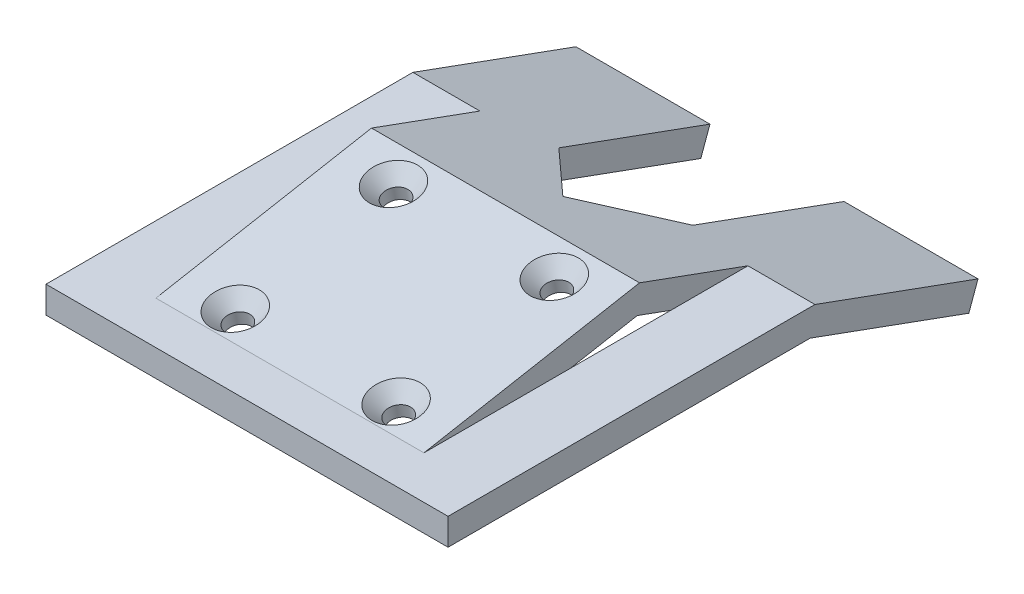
ISO-10303-21;
HEADER;
FILE_DESCRIPTION(('STEP AP214'),'2;1');
FILE_NAME('part.step','',(''),(''),'','','');
FILE_SCHEMA(('AUTOMOTIVE_DESIGN { 1 0 10303 214 1 1 1 1 }'));
ENDSEC;
DATA;
#1=APPLICATION_CONTEXT('core data for automotive mechanical design processes');
#2=APPLICATION_PROTOCOL_DEFINITION('international standard','automotive_design',2000,#1);
#3=PRODUCT_CONTEXT('',#1,'mechanical');
#4=PRODUCT('Part','Part','',(#3));
#5=PRODUCT_RELATED_PRODUCT_CATEGORY('part','',(#4));
#6=PRODUCT_DEFINITION_FORMATION('','',#4);
#7=PRODUCT_DEFINITION_CONTEXT('part definition',#1,'design');
#8=PRODUCT_DEFINITION('design','',#6,#7);
#9=PRODUCT_DEFINITION_SHAPE('','',#8);
#10=(LENGTH_UNIT() NAMED_UNIT(*) SI_UNIT(.MILLI.,.METRE.));
#11=(NAMED_UNIT(*) PLANE_ANGLE_UNIT() SI_UNIT($,.RADIAN.));
#12=(NAMED_UNIT(*) SI_UNIT($,.STERADIAN.) SOLID_ANGLE_UNIT());
#13=UNCERTAINTY_MEASURE_WITH_UNIT(LENGTH_MEASURE(1.E-05),#10,'distance_accuracy_value','');
#14=(GEOMETRIC_REPRESENTATION_CONTEXT(3) GLOBAL_UNCERTAINTY_ASSIGNED_CONTEXT((#13)) GLOBAL_UNIT_ASSIGNED_CONTEXT((#10,
#11,#12)) REPRESENTATION_CONTEXT('',''));
#15=CARTESIAN_POINT('',(0.,0.,0.));
#16=DIRECTION('',(0.,0.,1.));
#17=DIRECTION('',(1.,0.,0.));
#18=AXIS2_PLACEMENT_3D('',#15,#16,#17);
#19=CARTESIAN_POINT('',(-37.5,-2.5,-67.5591825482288));
#20=DIRECTION('',(0.,0.939692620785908,-0.342020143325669));
#21=DIRECTION('',(0.,0.342020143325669,0.939692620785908));
#22=AXIS2_PLACEMENT_3D('',#19,#20,#21);
#23=PLANE('',#22);
#24=DIRECTION('',(0.707106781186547,-0.241844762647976,-0.664463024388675));
#25=VECTOR('',#24,1.);
#26=CARTESIAN_POINT('',(-13.2422578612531,5.79663644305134,-44.764361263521));
#27=LINE('',#26,#25);
#28=CARTESIAN_POINT('',(11.9537005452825,-2.82088886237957,-68.4408174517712));
#29=VERTEX_POINT('',#28);
#30=CARTESIAN_POINT('',(12.5,-3.00773428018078,-68.9541710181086));
#31=VERTEX_POINT('',#30);
#32=EDGE_CURVE('E282',#29,#31,#27,.T.);
#33=ORIENTED_EDGE('',*,*,#32,.T.);
#34=DIRECTION('',(0.,-0.342020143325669,-0.939692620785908));
#35=VECTOR('',#34,1.);
#36=CARTESIAN_POINT('',(12.5,-2.5,-67.5591825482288));
#37=LINE('',#36,#35);
#38=CARTESIAN_POINT('',(12.5,-13.2683385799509,-97.1449496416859));
#39=VERTEX_POINT('',#38);
#40=EDGE_CURVE('E286',#31,#39,#37,.T.);
#41=ORIENTED_EDGE('',*,*,#40,.T.);
#42=DIRECTION('',(-1.,0.,0.));
#43=VECTOR('',#42,1.);
#44=CARTESIAN_POINT('',(-37.5,-13.2683385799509,-97.1449496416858));
#45=LINE('',#44,#43);
#46=CARTESIAN_POINT('',(37.5,-13.2683385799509,-97.1449496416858));
#47=VERTEX_POINT('',#46);
#48=EDGE_CURVE('E372',#47,#39,#45,.T.);
#49=ORIENTED_EDGE('',*,*,#48,.F.);
#50=DIRECTION('',(0.,-0.342020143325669,-0.939692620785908));
#51=VECTOR('',#50,1.);
#52=CARTESIAN_POINT('',(37.5,-2.5,-67.5591825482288));
#53=LINE('',#52,#51);
#54=CARTESIAN_POINT('',(37.5,-2.5,-67.5591825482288));
#55=VERTEX_POINT('',#54);
#56=EDGE_CURVE('E406',#55,#47,#53,.T.);
#57=ORIENTED_EDGE('',*,*,#56,.F.);
#58=DIRECTION('',(1.,0.,0.));
#59=VECTOR('',#58,1.);
#60=CARTESIAN_POINT('',(-37.5,-2.5,-67.5591825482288));
#61=LINE('',#60,#59);
#62=CARTESIAN_POINT('',(25.,-2.5,-67.5591825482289));
#63=VERTEX_POINT('',#62);
#64=EDGE_CURVE('E379',#63,#55,#61,.T.);
#65=ORIENTED_EDGE('',*,*,#64,.F.);
#66=DIRECTION('',(0.,-0.342020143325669,-0.939692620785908));
#67=VECTOR('',#66,1.);
#68=CARTESIAN_POINT('',(25.,-2.5,-67.5591825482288));
#69=LINE('',#68,#67);
#70=CARTESIAN_POINT('',(25.,-2.82088886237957,-68.4408174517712));
#71=VERTEX_POINT('',#70);
#72=EDGE_CURVE('E362',#63,#71,#69,.T.);
#73=ORIENTED_EDGE('',*,*,#72,.T.);
#74=DIRECTION('',(-1.,0.,0.));
#75=VECTOR('',#74,1.);
#76=CARTESIAN_POINT('',(-37.5,-2.82088886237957,-68.4408174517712));
#77=LINE('',#76,#75);
#78=EDGE_CURVE('E365',#71,#29,#77,.T.);
#79=ORIENTED_EDGE('',*,*,#78,.T.);
#80=EDGE_LOOP('',(#33,#41,#49,#57,#65,#73,#79));
#81=FACE_BOUND('',#80,.T.);
#82=ADVANCED_FACE('F36',(#81),#23,.F.);
#83=CARTESIAN_POINT('',(0.,-10.9191070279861,-98.));
#84=DIRECTION('',(0.,-0.342020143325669,-0.939692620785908));
#85=DIRECTION('',(0.,0.939692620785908,-0.342020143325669));
#86=AXIS2_PLACEMENT_3D('',#83,#84,#85);
#87=PLANE('',#86);
#88=DIRECTION('',(0.,-0.939692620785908,0.342020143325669));
#89=VECTOR('',#88,1.);
#90=CARTESIAN_POINT('',(12.5,-10.9191070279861,-98.));
#91=LINE('',#90,#89);
#92=CARTESIAN_POINT('',(12.5,-8.56987547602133,-98.8550503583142));
#93=VERTEX_POINT('',#92);
#94=EDGE_CURVE('E12',#93,#39,#91,.T.);
#95=ORIENTED_EDGE('',*,*,#94,.F.);
#96=DIRECTION('',(1.,0.,0.));
#97=VECTOR('',#96,1.);
#98=CARTESIAN_POINT('',(-37.5,-8.56987547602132,-98.8550503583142));
#99=LINE('',#98,#97);
#100=CARTESIAN_POINT('',(37.5,-8.56987547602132,-98.8550503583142));
#101=VERTEX_POINT('',#100);
#102=EDGE_CURVE('E215',#93,#101,#99,.T.);
#103=ORIENTED_EDGE('',*,*,#102,.T.);
#104=DIRECTION('',(0.,-0.939692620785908,0.342020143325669));
#105=VECTOR('',#104,1.);
#106=CARTESIAN_POINT('',(37.5,-1.11847977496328,-101.567136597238));
#107=LINE('',#106,#105);
#108=EDGE_CURVE('E369',#101,#47,#107,.T.);
#109=ORIENTED_EDGE('',*,*,#108,.T.);
#110=ORIENTED_EDGE('',*,*,#48,.T.);
#111=EDGE_LOOP('',(#95,#103,#109,#110));
#112=FACE_BOUND('',#111,.T.);
#113=ADVANCED_FACE('F452',(#112),#87,.T.);
#114=CARTESIAN_POINT('',(-25.,-13.2683385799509,-68.4408174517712));
#115=DIRECTION('',(0.,0.,-1.));
#116=DIRECTION('',(-1.,0.,0.));
#117=AXIS2_PLACEMENT_3D('',#114,#115,#116);
#118=PLANE('',#117);
#119=DIRECTION('',(1.,0.,0.));
#120=VECTOR('',#119,1.);
#121=CARTESIAN_POINT('',(25.,-2.73398666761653,-68.4408174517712));
#122=LINE('',#121,#120);
#123=CARTESIAN_POINT('',(11.9239782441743,-2.73398666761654,-68.4408174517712));
#124=VERTEX_POINT('',#123);
#125=CARTESIAN_POINT('',(25.,-2.73398666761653,-68.4408174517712));
#126=VERTEX_POINT('',#125);
#127=EDGE_CURVE('E308',#124,#126,#122,.T.);
#128=ORIENTED_EDGE('',*,*,#127,.F.);
#129=DIRECTION('',(0.323615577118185,-0.946188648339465,0.));
#130=VECTOR('',#129,1.);
#131=CARTESIAN_POINT('',(11.2826723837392,-0.858933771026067,-68.4408174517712));
#132=LINE('',#131,#130);
#133=EDGE_CURVE('E255',#124,#29,#132,.T.);
#134=ORIENTED_EDGE('',*,*,#133,.T.);
#135=ORIENTED_EDGE('',*,*,#78,.F.);
#136=DIRECTION('',(0.,1.,0.));
#137=VECTOR('',#136,1.);
#138=CARTESIAN_POINT('',(25.,-13.2683385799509,-68.4408174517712));
#139=LINE('',#138,#137);
#140=EDGE_CURVE('E354',#71,#126,#139,.T.);
#141=ORIENTED_EDGE('',*,*,#140,.T.);
#142=EDGE_LOOP('',(#128,#134,#135,#141));
#143=FACE_BOUND('',#142,.T.);
#144=ADVANCED_FACE('F479',(#143),#118,.F.);
#145=CARTESIAN_POINT('',(25.,-13.2683385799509,-8.));
#146=DIRECTION('',(1.,0.,0.));
#147=DIRECTION('',(0.,0.,-1.));
#148=AXIS2_PLACEMENT_3D('',#145,#146,#147);
#149=PLANE('',#148);
#150=DIRECTION('',(0.,0.,-1.));
#151=VECTOR('',#150,1.);
#152=CARTESIAN_POINT('',(25.,2.5,-8.));
#153=LINE('',#152,#151);
#154=CARTESIAN_POINT('',(25.,2.5,-35.3250324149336));
#155=VERTEX_POINT('',#154);
#156=CARTESIAN_POINT('',(25.,2.50000000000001,-54.0605572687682));
#157=VERTEX_POINT('',#156);
#158=EDGE_CURVE('E343',#155,#157,#153,.T.);
#159=ORIENTED_EDGE('',*,*,#158,.T.);
#160=DIRECTION('',(0.,-0.342020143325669,-0.939692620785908));
#161=VECTOR('',#160,1.);
#162=CARTESIAN_POINT('',(25.,4.78134691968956,-47.7926081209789));
#163=LINE('',#162,#161);
#164=EDGE_CURVE('E332',#157,#126,#163,.T.);
#165=ORIENTED_EDGE('',*,*,#164,.T.);
#166=ORIENTED_EDGE('',*,*,#140,.F.);
#167=ORIENTED_EDGE('',*,*,#72,.F.);
#168=DIRECTION('',(0.,0.,1.));
#169=VECTOR('',#168,1.);
#170=CARTESIAN_POINT('',(25.,-2.5,-143.166481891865));
#171=LINE('',#170,#169);
#172=CARTESIAN_POINT('',(25.,-2.5,-8.));
#173=VERTEX_POINT('',#172);
#174=EDGE_CURVE('E225',#63,#173,#171,.T.);
#175=ORIENTED_EDGE('',*,*,#174,.T.);
#176=DIRECTION('',(0.,-0.179993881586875,0.983667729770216));
#177=VECTOR('',#176,1.);
#178=CARTESIAN_POINT('',(25.,13.8650675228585,-97.4352001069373));
#179=LINE('',#178,#177);
#180=EDGE_CURVE('E59',#155,#173,#179,.T.);
#181=ORIENTED_EDGE('',*,*,#180,.F.);
#182=EDGE_LOOP('',(#159,#165,#166,#167,#175,#181));
#183=FACE_BOUND('',#182,.T.);
#184=ADVANCED_FACE('F476',(#183),#149,.F.);
#185=CARTESIAN_POINT('',(-25.,-13.2683385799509,-8.));
#186=DIRECTION('',(-1.,0.,0.));
#187=DIRECTION('',(0.,0.,1.));
#188=AXIS2_PLACEMENT_3D('',#185,#186,#187);
#189=PLANE('',#188);
#190=DIRECTION('',(0.,1.,0.));
#191=VECTOR('',#190,1.);
#192=CARTESIAN_POINT('',(-25.,-13.2683385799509,-68.4408174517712));
#193=LINE('',#192,#191);
#194=CARTESIAN_POINT('',(-25.,-2.82088886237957,-68.4408174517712));
#195=VERTEX_POINT('',#194);
#196=CARTESIAN_POINT('',(-25.,-2.73398666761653,-68.4408174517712));
#197=VERTEX_POINT('',#196);
#198=EDGE_CURVE('E355',#195,#197,#193,.T.);
#199=ORIENTED_EDGE('',*,*,#198,.T.);
#200=DIRECTION('',(0.,-0.342020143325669,-0.939692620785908));
#201=VECTOR('',#200,1.);
#202=CARTESIAN_POINT('',(-25.,4.78134691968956,-47.7926081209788));
#203=LINE('',#202,#201);
#204=CARTESIAN_POINT('',(-25.,2.5,-54.0605572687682));
#205=VERTEX_POINT('',#204);
#206=EDGE_CURVE('E329',#205,#197,#203,.T.);
#207=ORIENTED_EDGE('',*,*,#206,.F.);
#208=DIRECTION('',(0.,0.,1.));
#209=VECTOR('',#208,1.);
#210=CARTESIAN_POINT('',(-25.,2.5,-8.));
#211=LINE('',#210,#209);
#212=CARTESIAN_POINT('',(-25.,2.5,-35.3250324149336));
#213=VERTEX_POINT('',#212);
#214=EDGE_CURVE('E347',#205,#213,#211,.T.);
#215=ORIENTED_EDGE('',*,*,#214,.T.);
#216=DIRECTION('',(0.,-0.179993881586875,0.983667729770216));
#217=VECTOR('',#216,1.);
#218=CARTESIAN_POINT('',(-25.,13.8650675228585,-97.4352001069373));
#219=LINE('',#218,#217);
#220=CARTESIAN_POINT('',(-25.,-2.5,-8.));
#221=VERTEX_POINT('',#220);
#222=EDGE_CURVE('E322',#213,#221,#219,.T.);
#223=ORIENTED_EDGE('',*,*,#222,.T.);
#224=DIRECTION('',(0.,0.,-1.));
#225=VECTOR('',#224,1.);
#226=CARTESIAN_POINT('',(-25.,-2.5,-143.166481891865));
#227=LINE('',#226,#225);
#228=CARTESIAN_POINT('',(-25.,-2.5,-67.5591825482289));
#229=VERTEX_POINT('',#228);
#230=EDGE_CURVE('E214',#221,#229,#227,.T.);
#231=ORIENTED_EDGE('',*,*,#230,.T.);
#232=DIRECTION('',(0.,0.342020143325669,0.939692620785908));
#233=VECTOR('',#232,1.);
#234=CARTESIAN_POINT('',(-25.,-2.5,-67.5591825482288));
#235=LINE('',#234,#233);
#236=EDGE_CURVE('E357',#195,#229,#235,.T.);
#237=ORIENTED_EDGE('',*,*,#236,.F.);
#238=EDGE_LOOP('',(#199,#207,#215,#223,#231,#237));
#239=FACE_BOUND('',#238,.T.);
#240=ADVANCED_FACE('F429',(#239),#189,.F.);
#241=DIRECTION('',(0.,0.342020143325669,0.939692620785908));
#242=VECTOR('',#241,1.);
#243=CARTESIAN_POINT('',(-12.5,-2.5,-67.5591825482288));
#244=LINE('',#243,#242);
#245=CARTESIAN_POINT('',(-12.5,-13.2683385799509,-97.1449496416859));
#246=VERTEX_POINT('',#245);
#247=CARTESIAN_POINT('',(-12.5,-3.0077342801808,-68.9541710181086));
#248=VERTEX_POINT('',#247);
#249=EDGE_CURVE('E197',#246,#248,#244,.T.);
#250=ORIENTED_EDGE('',*,*,#249,.T.);
#251=DIRECTION('',(0.707106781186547,0.241844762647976,0.664463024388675));
#252=VECTOR('',#251,1.);
#253=CARTESIAN_POINT('',(-24.2577421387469,-7.02911893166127,-80.0028345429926));
#254=LINE('',#253,#252);
#255=CARTESIAN_POINT('',(-11.9537005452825,-2.82088886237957,-68.4408174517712));
#256=VERTEX_POINT('',#255);
#257=EDGE_CURVE('E272',#248,#256,#254,.T.);
#258=ORIENTED_EDGE('',*,*,#257,.T.);
#259=EDGE_CURVE('E271',#256,#195,#77,.T.);
#260=ORIENTED_EDGE('',*,*,#259,.T.);
#261=ORIENTED_EDGE('',*,*,#236,.T.);
#262=CARTESIAN_POINT('',(-37.5,-2.5,-67.5591825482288));
#263=VERTEX_POINT('',#262);
#264=EDGE_CURVE('E381',#263,#229,#61,.T.);
#265=ORIENTED_EDGE('',*,*,#264,.F.);
#266=DIRECTION('',(0.,-0.342020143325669,-0.939692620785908));
#267=VECTOR('',#266,1.);
#268=CARTESIAN_POINT('',(-37.5,-2.5,-67.5591825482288));
#269=LINE('',#268,#267);
#270=CARTESIAN_POINT('',(-37.5,-13.2683385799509,-97.1449496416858));
#271=VERTEX_POINT('',#270);
#272=EDGE_CURVE('E384',#263,#271,#269,.T.);
#273=ORIENTED_EDGE('',*,*,#272,.T.);
#274=EDGE_CURVE('E371',#246,#271,#45,.T.);
#275=ORIENTED_EDGE('',*,*,#274,.F.);
#276=EDGE_LOOP('',(#250,#258,#260,#261,#265,#273,#275));
#277=FACE_BOUND('',#276,.T.);
#278=ADVANCED_FACE('F465',(#277),#23,.F.);
#279=CARTESIAN_POINT('',(-37.5,2.5,-68.4408174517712));
#280=DIRECTION('',(0.,-0.939692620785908,0.342020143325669));
#281=DIRECTION('',(0.,-0.342020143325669,-0.939692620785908));
#282=AXIS2_PLACEMENT_3D('',#279,#280,#281);
#283=PLANE('',#282);
#284=ORIENTED_EDGE('',*,*,#102,.F.);
#285=DIRECTION('',(0.,-0.342020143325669,-0.939692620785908));
#286=VECTOR('',#285,1.);
#287=CARTESIAN_POINT('',(12.5,-8.56987547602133,-98.8550503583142));
#288=LINE('',#287,#286);
#289=CARTESIAN_POINT('',(12.5,1.69072882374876,-70.664271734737));
#290=VERTEX_POINT('',#289);
#291=EDGE_CURVE('E460',#290,#93,#288,.T.);
#292=ORIENTED_EDGE('',*,*,#291,.F.);
#293=DIRECTION('',(0.707106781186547,-0.241844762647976,-0.664463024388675));
#294=VECTOR('',#293,1.);
#295=CARTESIAN_POINT('',(12.5,1.69072882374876,-70.664271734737));
#296=LINE('',#295,#294);
#297=CARTESIAN_POINT('',(0.,5.96598061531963,-58.9181139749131));
#298=VERTEX_POINT('',#297);
#299=EDGE_CURVE('E458',#298,#290,#296,.T.);
#300=ORIENTED_EDGE('',*,*,#299,.F.);
#301=DIRECTION('',(0.707106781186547,0.241844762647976,0.664463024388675));
#302=VECTOR('',#301,1.);
#303=CARTESIAN_POINT('',(0.,5.96598061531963,-58.9181139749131));
#304=LINE('',#303,#302);
#305=CARTESIAN_POINT('',(-12.5,1.69072882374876,-70.664271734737));
#306=VERTEX_POINT('',#305);
#307=EDGE_CURVE('E208',#306,#298,#304,.T.);
#308=ORIENTED_EDGE('',*,*,#307,.F.);
#309=DIRECTION('',(0.,0.342020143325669,0.939692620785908));
#310=VECTOR('',#309,1.);
#311=CARTESIAN_POINT('',(-12.5,1.69072882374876,-70.664271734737));
#312=LINE('',#311,#310);
#313=CARTESIAN_POINT('',(-12.5,-8.56987547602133,-98.8550503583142));
#314=VERTEX_POINT('',#313);
#315=EDGE_CURVE('E194',#314,#306,#312,.T.);
#316=ORIENTED_EDGE('',*,*,#315,.F.);
#317=CARTESIAN_POINT('',(-37.5,-8.56987547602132,-98.8550503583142));
#318=VERTEX_POINT('',#317);
#319=EDGE_CURVE('E206',#318,#314,#99,.T.);
#320=ORIENTED_EDGE('',*,*,#319,.F.);
#321=DIRECTION('',(0.,-0.342020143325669,-0.939692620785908));
#322=VECTOR('',#321,1.);
#323=CARTESIAN_POINT('',(-37.5,2.5,-68.4408174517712));
#324=LINE('',#323,#322);
#325=CARTESIAN_POINT('',(-37.5,2.5,-68.4408174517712));
#326=VERTEX_POINT('',#325);
#327=EDGE_CURVE('E220',#326,#318,#324,.T.);
#328=ORIENTED_EDGE('',*,*,#327,.F.);
#329=DIRECTION('',(-1.,0.,0.));
#330=VECTOR('',#329,1.);
#331=CARTESIAN_POINT('',(-37.5,2.5,-68.4408174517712));
#332=LINE('',#331,#330);
#333=CARTESIAN_POINT('',(-25.,2.50000000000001,-68.4408174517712));
#334=VERTEX_POINT('',#333);
#335=EDGE_CURVE('E380',#334,#326,#332,.T.);
#336=ORIENTED_EDGE('',*,*,#335,.F.);
#337=DIRECTION('',(0.,-0.342020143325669,-0.939692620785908));
#338=VECTOR('',#337,1.);
#339=CARTESIAN_POINT('',(-25.,9.85962690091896,-48.2204087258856));
#340=LINE('',#339,#338);
#341=CARTESIAN_POINT('',(-25.,9.85962690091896,-48.2204087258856));
#342=VERTEX_POINT('',#341);
#343=EDGE_CURVE('E316',#342,#334,#340,.T.);
#344=ORIENTED_EDGE('',*,*,#343,.F.);
#345=DIRECTION('',(1.,0.,0.));
#346=VECTOR('',#345,1.);
#347=CARTESIAN_POINT('',(-25.,9.85962690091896,-48.2204087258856));
#348=LINE('',#347,#346);
#349=CARTESIAN_POINT('',(25.,9.85962690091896,-48.2204087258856));
#350=VERTEX_POINT('',#349);
#351=EDGE_CURVE('E312',#342,#350,#348,.T.);
#352=ORIENTED_EDGE('',*,*,#351,.T.);
#353=DIRECTION('',(0.,-0.342020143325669,-0.939692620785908));
#354=VECTOR('',#353,1.);
#355=CARTESIAN_POINT('',(25.,9.85962690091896,-48.2204087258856));
#356=LINE('',#355,#354);
#357=CARTESIAN_POINT('',(25.,2.5,-68.4408174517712));
#358=VERTEX_POINT('',#357);
#359=EDGE_CURVE('E336',#350,#358,#356,.T.);
#360=ORIENTED_EDGE('',*,*,#359,.T.);
#361=CARTESIAN_POINT('',(37.5,2.5,-68.4408174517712));
#362=VERTEX_POINT('',#361);
#363=EDGE_CURVE('E376',#362,#358,#332,.T.);
#364=ORIENTED_EDGE('',*,*,#363,.F.);
#365=DIRECTION('',(0.,-0.342020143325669,-0.939692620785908));
#366=VECTOR('',#365,1.);
#367=CARTESIAN_POINT('',(37.5,2.5,-68.4408174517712));
#368=LINE('',#367,#366);
#369=EDGE_CURVE('E408',#362,#101,#368,.T.);
#370=ORIENTED_EDGE('',*,*,#369,.T.);
#371=EDGE_LOOP('',(#284,#292,#300,#308,#316,#320,#328,#336,#344,#352,#360,#364,#370));
#372=FACE_BOUND('',#371,.T.);
#373=ADVANCED_FACE('F38',(#372),#283,.F.);
#374=CARTESIAN_POINT('',(37.5,2.5,0.));
#375=DIRECTION('',(0.,0.,-1.));
#376=DIRECTION('',(-1.,0.,0.));
#377=AXIS2_PLACEMENT_3D('',#374,#375,#376);
#378=PLANE('',#377);
#379=DIRECTION('',(0.,1.,0.));
#380=VECTOR('',#379,1.);
#381=CARTESIAN_POINT('',(37.5,-2.5,0.));
#382=LINE('',#381,#380);
#383=CARTESIAN_POINT('',(37.5,-2.5,0.));
#384=VERTEX_POINT('',#383);
#385=CARTESIAN_POINT('',(37.5,2.5,0.));
#386=VERTEX_POINT('',#385);
#387=EDGE_CURVE('E368',#384,#386,#382,.T.);
#388=ORIENTED_EDGE('',*,*,#387,.T.);
#389=DIRECTION('',(-1.,0.,0.));
#390=VECTOR('',#389,1.);
#391=CARTESIAN_POINT('',(-37.5,2.5,0.));
#392=LINE('',#391,#390);
#393=CARTESIAN_POINT('',(-37.5,2.5,0.));
#394=VERTEX_POINT('',#393);
#395=EDGE_CURVE('E387',#386,#394,#392,.T.);
#396=ORIENTED_EDGE('',*,*,#395,.T.);
#397=DIRECTION('',(0.,-1.,0.));
#398=VECTOR('',#397,1.);
#399=CARTESIAN_POINT('',(-37.5,-2.5,0.));
#400=LINE('',#399,#398);
#401=CARTESIAN_POINT('',(-37.5,-2.5,0.));
#402=VERTEX_POINT('',#401);
#403=EDGE_CURVE('E390',#394,#402,#400,.T.);
#404=ORIENTED_EDGE('',*,*,#403,.T.);
#405=DIRECTION('',(1.,0.,0.));
#406=VECTOR('',#405,1.);
#407=CARTESIAN_POINT('',(-37.5,-2.5,0.));
#408=LINE('',#407,#406);
#409=EDGE_CURVE('E393',#402,#384,#408,.T.);
#410=ORIENTED_EDGE('',*,*,#409,.T.);
#411=EDGE_LOOP('',(#388,#396,#404,#410));
#412=FACE_BOUND('',#411,.T.);
#413=ADVANCED_FACE('F471',(#412),#378,.F.);
#414=CARTESIAN_POINT('',(37.5,-2.5,-143.166481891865));
#415=DIRECTION('',(1.,0.,0.));
#416=DIRECTION('',(0.,0.,-1.));
#417=AXIS2_PLACEMENT_3D('',#414,#415,#416);
#418=PLANE('',#417);
#419=DIRECTION('',(0.,0.,1.));
#420=VECTOR('',#419,1.);
#421=CARTESIAN_POINT('',(37.5,-2.5,-143.166481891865));
#422=LINE('',#421,#420);
#423=EDGE_CURVE('E397',#55,#384,#422,.T.);
#424=ORIENTED_EDGE('',*,*,#423,.F.);
#425=ORIENTED_EDGE('',*,*,#56,.T.);
#426=ORIENTED_EDGE('',*,*,#108,.F.);
#427=ORIENTED_EDGE('',*,*,#369,.F.);
#428=DIRECTION('',(0.,0.,1.));
#429=VECTOR('',#428,1.);
#430=CARTESIAN_POINT('',(37.5,2.5,-143.166481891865));
#431=LINE('',#430,#429);
#432=EDGE_CURVE('E396',#362,#386,#431,.T.);
#433=ORIENTED_EDGE('',*,*,#432,.T.);
#434=ORIENTED_EDGE('',*,*,#387,.F.);
#435=EDGE_LOOP('',(#424,#425,#426,#427,#433,#434));
#436=FACE_BOUND('',#435,.T.);
#437=ADVANCED_FACE('F446',(#436),#418,.T.);
#438=CARTESIAN_POINT('',(-37.5,2.5,-143.166481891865));
#439=DIRECTION('',(0.,1.,0.));
#440=DIRECTION('',(0.,0.,1.));
#441=AXIS2_PLACEMENT_3D('',#438,#439,#440);
#442=PLANE('',#441);
#443=CARTESIAN_POINT('',(25.,2.5,-8.));
#444=VERTEX_POINT('',#443);
#445=EDGE_CURVE('E344',#444,#155,#153,.T.);
#446=ORIENTED_EDGE('',*,*,#445,.F.);
#447=DIRECTION('',(1.,0.,0.));
#448=VECTOR('',#447,1.);
#449=CARTESIAN_POINT('',(-25.,2.5,-8.));
#450=LINE('',#449,#448);
#451=CARTESIAN_POINT('',(-25.,2.5,-8.));
#452=VERTEX_POINT('',#451);
#453=EDGE_CURVE('E351',#452,#444,#450,.T.);
#454=ORIENTED_EDGE('',*,*,#453,.F.);
#455=DIRECTION('',(0.,0.,-1.));
#456=VECTOR('',#455,1.);
#457=CARTESIAN_POINT('',(-25.,2.5,-143.166481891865));
#458=LINE('',#457,#456);
#459=EDGE_CURVE('E341',#452,#213,#458,.T.);
#460=ORIENTED_EDGE('',*,*,#459,.T.);
#461=ORIENTED_EDGE('',*,*,#214,.F.);
#462=EDGE_CURVE('E348',#334,#205,#211,.T.);
#463=ORIENTED_EDGE('',*,*,#462,.F.);
#464=ORIENTED_EDGE('',*,*,#335,.T.);
#465=DIRECTION('',(0.,0.,1.));
#466=VECTOR('',#465,1.);
#467=CARTESIAN_POINT('',(-37.5,2.5,-143.166481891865));
#468=LINE('',#467,#466);
#469=EDGE_CURVE('E401',#326,#394,#468,.T.);
#470=ORIENTED_EDGE('',*,*,#469,.T.);
#471=ORIENTED_EDGE('',*,*,#395,.F.);
#472=ORIENTED_EDGE('',*,*,#432,.F.);
#473=ORIENTED_EDGE('',*,*,#363,.T.);
#474=DIRECTION('',(0.,0.,1.));
#475=VECTOR('',#474,1.);
#476=CARTESIAN_POINT('',(25.,2.5,-143.166481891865));
#477=LINE('',#476,#475);
#478=EDGE_CURVE('E307',#358,#157,#477,.T.);
#479=ORIENTED_EDGE('',*,*,#478,.T.);
#480=ORIENTED_EDGE('',*,*,#158,.F.);
#481=EDGE_LOOP('',(#446,#454,#460,#461,#463,#464,#470,#471,#472,#473,#479,#480));
#482=FACE_BOUND('',#481,.T.);
#483=ADVANCED_FACE('F419',(#482),#442,.T.);
#484=CARTESIAN_POINT('',(-37.5,-2.5,-143.166481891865));
#485=DIRECTION('',(-1.,0.,0.));
#486=DIRECTION('',(0.,0.,1.));
#487=AXIS2_PLACEMENT_3D('',#484,#485,#486);
#488=PLANE('',#487);
#489=ORIENTED_EDGE('',*,*,#469,.F.);
#490=ORIENTED_EDGE('',*,*,#327,.T.);
#491=DIRECTION('',(0.,0.939692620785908,-0.342020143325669));
#492=VECTOR('',#491,1.);
#493=CARTESIAN_POINT('',(-37.5,-1.11847977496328,-101.567136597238));
#494=LINE('',#493,#492);
#495=EDGE_CURVE('E212',#271,#318,#494,.T.);
#496=ORIENTED_EDGE('',*,*,#495,.F.);
#497=ORIENTED_EDGE('',*,*,#272,.F.);
#498=DIRECTION('',(0.,0.,1.));
#499=VECTOR('',#498,1.);
#500=CARTESIAN_POINT('',(-37.5,-2.5,-143.166481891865));
#501=LINE('',#500,#499);
#502=EDGE_CURVE('E399',#263,#402,#501,.T.);
#503=ORIENTED_EDGE('',*,*,#502,.T.);
#504=ORIENTED_EDGE('',*,*,#403,.F.);
#505=EDGE_LOOP('',(#489,#490,#496,#497,#503,#504));
#506=FACE_BOUND('',#505,.T.);
#507=ADVANCED_FACE('F413',(#506),#488,.T.);
#508=CARTESIAN_POINT('',(-37.5,-2.5,-143.166481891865));
#509=DIRECTION('',(0.,-1.,0.));
#510=DIRECTION('',(0.,0.,-1.));
#511=AXIS2_PLACEMENT_3D('',#508,#509,#510);
#512=PLANE('',#511);
#513=ORIENTED_EDGE('',*,*,#174,.F.);
#514=ORIENTED_EDGE('',*,*,#64,.T.);
#515=ORIENTED_EDGE('',*,*,#423,.T.);
#516=ORIENTED_EDGE('',*,*,#409,.F.);
#517=ORIENTED_EDGE('',*,*,#502,.F.);
#518=ORIENTED_EDGE('',*,*,#264,.T.);
#519=ORIENTED_EDGE('',*,*,#230,.F.);
#520=DIRECTION('',(-1.,0.,0.));
#521=VECTOR('',#520,1.);
#522=CARTESIAN_POINT('',(-37.5,-2.5,-8.00000000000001));
#523=LINE('',#522,#521);
#524=EDGE_CURVE('E217',#173,#221,#523,.T.);
#525=ORIENTED_EDGE('',*,*,#524,.F.);
#526=EDGE_LOOP('',(#513,#514,#515,#516,#517,#518,#519,#525));
#527=FACE_BOUND('',#526,.T.);
#528=ADVANCED_FACE('F473',(#527),#512,.T.);
#529=DIRECTION('',(0.,0.939692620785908,-0.342020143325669));
#530=VECTOR('',#529,1.);
#531=CARTESIAN_POINT('',(-12.5,-10.9191070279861,-98.));
#532=LINE('',#531,#530);
#533=EDGE_CURVE('E44',#246,#314,#532,.T.);
#534=ORIENTED_EDGE('',*,*,#533,.F.);
#535=ORIENTED_EDGE('',*,*,#274,.T.);
#536=ORIENTED_EDGE('',*,*,#495,.T.);
#537=ORIENTED_EDGE('',*,*,#319,.T.);
#538=EDGE_LOOP('',(#534,#535,#536,#537));
#539=FACE_BOUND('',#538,.T.);
#540=ADVANCED_FACE('F210',(#539),#87,.T.);
#541=ORIENTED_EDGE('',*,*,#259,.F.);
#542=DIRECTION('',(0.323615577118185,0.946188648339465,0.));
#543=VECTOR('',#542,1.);
#544=CARTESIAN_POINT('',(-16.519024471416,-16.1690030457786,-68.4408174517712));
#545=LINE('',#544,#543);
#546=CARTESIAN_POINT('',(-11.9239782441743,-2.73398666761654,-68.4408174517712));
#547=VERTEX_POINT('',#546);
#548=EDGE_CURVE('E264',#256,#547,#545,.T.);
#549=ORIENTED_EDGE('',*,*,#548,.T.);
#550=EDGE_CURVE('E261',#197,#547,#122,.T.);
#551=ORIENTED_EDGE('',*,*,#550,.F.);
#552=ORIENTED_EDGE('',*,*,#198,.F.);
#553=EDGE_LOOP('',(#541,#549,#551,#552));
#554=FACE_BOUND('',#553,.T.);
#555=ADVANCED_FACE('F268',(#554),#118,.F.);
#556=CARTESIAN_POINT('',(25.,4.78134691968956,-47.7926081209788));
#557=DIRECTION('',(0.,-0.939692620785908,0.342020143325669));
#558=DIRECTION('',(0.,-0.342020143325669,-0.939692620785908));
#559=AXIS2_PLACEMENT_3D('',#556,#557,#558);
#560=PLANE('',#559);
#561=DIRECTION('',(-0.707106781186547,0.241844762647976,0.664463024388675));
#562=VECTOR('',#561,1.);
#563=CARTESIAN_POINT('',(7.47530641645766,-1.21245129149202,-64.2604333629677));
#564=LINE('',#563,#562);
#565=CARTESIAN_POINT('',(0.,1.34425408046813,-57.2359430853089));
#566=VERTEX_POINT('',#565);
#567=EDGE_CURVE('E201',#124,#566,#564,.T.);
#568=ORIENTED_EDGE('',*,*,#567,.F.);
#569=ORIENTED_EDGE('',*,*,#127,.T.);
#570=ORIENTED_EDGE('',*,*,#164,.F.);
#571=CARTESIAN_POINT('',(25.,4.78134691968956,-47.7926081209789));
#572=VERTEX_POINT('',#571);
#573=EDGE_CURVE('E333',#572,#157,#163,.T.);
#574=ORIENTED_EDGE('',*,*,#573,.F.);
#575=DIRECTION('',(-1.,0.,0.));
#576=VECTOR('',#575,1.);
#577=CARTESIAN_POINT('',(25.,4.78134691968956,-47.7926081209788));
#578=LINE('',#577,#576);
#579=CARTESIAN_POINT('',(-25.,4.78134691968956,-47.7926081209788));
#580=VERTEX_POINT('',#579);
#581=EDGE_CURVE('E309',#572,#580,#578,.T.);
#582=ORIENTED_EDGE('',*,*,#581,.T.);
#583=EDGE_CURVE('E330',#580,#205,#203,.T.);
#584=ORIENTED_EDGE('',*,*,#583,.T.);
#585=ORIENTED_EDGE('',*,*,#206,.T.);
#586=ORIENTED_EDGE('',*,*,#550,.T.);
#587=DIRECTION('',(-0.707106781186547,-0.241844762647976,-0.664463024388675));
#588=VECTOR('',#587,1.);
#589=CARTESIAN_POINT('',(17.5246935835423,7.33805229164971,-40.76811784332));
#590=LINE('',#589,#588);
#591=EDGE_CURVE('E227',#566,#547,#590,.T.);
#592=ORIENTED_EDGE('',*,*,#591,.F.);
#593=EDGE_LOOP('',(#568,#569,#570,#574,#582,#584,#585,#586,#592));
#594=FACE_BOUND('',#593,.T.);
#595=ADVANCED_FACE('F259',(#594),#560,.T.);
#596=CARTESIAN_POINT('',(-25.,18.8650675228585,-97.4352001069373));
#597=DIRECTION('',(0.,-0.983667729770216,-0.179993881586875));
#598=DIRECTION('',(0.,0.179993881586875,-0.983667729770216));
#599=AXIS2_PLACEMENT_3D('',#596,#597,#598);
#600=PLANE('',#599);
#601=CARTESIAN_POINT('',(-15.,8.77966361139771,-42.3184023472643));
#602=DIRECTION('',(0.,0.983667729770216,0.179993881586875));
#603=DIRECTION('',(0.,-0.179993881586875,0.983667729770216));
#604=AXIS2_PLACEMENT_3D('',#601,#602,#603);
#605=CIRCLE('',#604,4.5593);
#606=CARTESIAN_POINT('',(-15.,7.95901750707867,-37.833566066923));
#607=VERTEX_POINT('',#606);
#608=EDGE_CURVE('E289',#607,#607,#605,.T.);
#609=ORIENTED_EDGE('',*,*,#608,.F.);
#610=EDGE_LOOP('',(#609));
#611=FACE_BOUND('',#610,.T.);
#612=CARTESIAN_POINT('',(15.,8.77966361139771,-42.3184023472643));
#613=DIRECTION('',(0.,0.983667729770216,0.179993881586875));
#614=DIRECTION('',(0.,-0.179993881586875,0.983667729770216));
#615=AXIS2_PLACEMENT_3D('',#612,#613,#614);
#616=CIRCLE('',#615,4.5593);
#617=CARTESIAN_POINT('',(15.,7.95901750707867,-37.833566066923));
#618=VERTEX_POINT('',#617);
#619=EDGE_CURVE('E246',#618,#618,#616,.T.);
#620=ORIENTED_EDGE('',*,*,#619,.F.);
#621=EDGE_LOOP('',(#620));
#622=FACE_BOUND('',#621,.T.);
#623=CARTESIAN_POINT('',(-15.,3.37984716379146,-12.8083704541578));
#624=DIRECTION('',(0.,0.983667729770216,0.179993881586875));
#625=DIRECTION('',(0.,-0.179993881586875,0.983667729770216));
#626=AXIS2_PLACEMENT_3D('',#623,#624,#625);
#627=CIRCLE('',#626,4.5593);
#628=CARTESIAN_POINT('',(-15.,2.55920105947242,-8.32353417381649));
#629=VERTEX_POINT('',#628);
#630=EDGE_CURVE('E241',#629,#629,#627,.T.);
#631=ORIENTED_EDGE('',*,*,#630,.F.);
#632=EDGE_LOOP('',(#631));
#633=FACE_BOUND('',#632,.T.);
#634=CARTESIAN_POINT('',(15.,3.37984716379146,-12.8083704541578));
#635=DIRECTION('',(0.,0.983667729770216,0.179993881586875));
#636=DIRECTION('',(0.,-0.179993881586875,0.983667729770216));
#637=AXIS2_PLACEMENT_3D('',#634,#635,#636);
#638=CIRCLE('',#637,4.5593);
#639=CARTESIAN_POINT('',(15.,2.55920105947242,-8.32353417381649));
#640=VERTEX_POINT('',#639);
#641=EDGE_CURVE('E236',#640,#640,#638,.T.);
#642=ORIENTED_EDGE('',*,*,#641,.F.);
#643=EDGE_LOOP('',(#642));
#644=FACE_BOUND('',#643,.T.);
#645=ORIENTED_EDGE('',*,*,#351,.F.);
#646=DIRECTION('',(0.,-0.179993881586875,0.983667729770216));
#647=VECTOR('',#646,1.);
#648=CARTESIAN_POINT('',(-25.,18.8650675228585,-97.4352001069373));
#649=LINE('',#648,#647);
#650=EDGE_CURVE('E319',#342,#452,#649,.T.);
#651=ORIENTED_EDGE('',*,*,#650,.T.);
#652=ORIENTED_EDGE('',*,*,#453,.T.);
#653=DIRECTION('',(0.,-0.179993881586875,0.983667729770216));
#654=VECTOR('',#653,1.);
#655=CARTESIAN_POINT('',(25.,18.8650675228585,-97.4352001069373));
#656=LINE('',#655,#654);
#657=EDGE_CURVE('E231',#350,#444,#656,.T.);
#658=ORIENTED_EDGE('',*,*,#657,.F.);
#659=EDGE_LOOP('',(#645,#651,#652,#658));
#660=FACE_BOUND('',#659,.T.);
#661=ADVANCED_FACE('F439',(#611,#622,#633,#644,#660),#600,.F.);
#662=CARTESIAN_POINT('',(-25.,13.8650675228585,-97.4352001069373));
#663=DIRECTION('',(1.,0.,0.));
#664=DIRECTION('',(0.,0.,-1.));
#665=AXIS2_PLACEMENT_3D('',#662,#663,#664);
#666=PLANE('',#665);
#667=ORIENTED_EDGE('',*,*,#459,.F.);
#668=ORIENTED_EDGE('',*,*,#650,.F.);
#669=ORIENTED_EDGE('',*,*,#343,.T.);
#670=ORIENTED_EDGE('',*,*,#462,.T.);
#671=ORIENTED_EDGE('',*,*,#583,.F.);
#672=EDGE_CURVE('E323',#580,#213,#219,.T.);
#673=ORIENTED_EDGE('',*,*,#672,.T.);
#674=EDGE_LOOP('',(#667,#668,#669,#670,#671,#673));
#675=FACE_BOUND('',#674,.T.);
#676=ADVANCED_FACE('F426',(#675),#666,.F.);
#677=CARTESIAN_POINT('',(25.,13.8650675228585,-97.4352001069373));
#678=DIRECTION('',(0.,0.983667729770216,0.179993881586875));
#679=DIRECTION('',(0.,-0.179993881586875,0.983667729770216));
#680=AXIS2_PLACEMENT_3D('',#677,#678,#679);
#681=PLANE('',#680);
#682=CARTESIAN_POINT('',(-15.,3.94165259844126,-43.2036732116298));
#683=DIRECTION('',(0.,0.983667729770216,0.179993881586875));
#684=DIRECTION('',(0.,-0.179993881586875,0.983667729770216));
#685=AXIS2_PLACEMENT_3D('',#682,#683,#684);
#686=CIRCLE('',#685,2.24789999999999);
#687=CARTESIAN_POINT('',(-15.,3.53704435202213,-40.9924865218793));
#688=VERTEX_POINT('',#687);
#689=EDGE_CURVE('E243',#688,#688,#686,.T.);
#690=ORIENTED_EDGE('',*,*,#689,.T.);
#691=EDGE_LOOP('',(#690));
#692=FACE_BOUND('',#691,.T.);
#693=CARTESIAN_POINT('',(15.,3.94165259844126,-43.2036732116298));
#694=DIRECTION('',(0.,0.983667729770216,0.179993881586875));
#695=DIRECTION('',(0.,-0.179993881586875,0.983667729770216));
#696=AXIS2_PLACEMENT_3D('',#693,#694,#695);
#697=CIRCLE('',#696,2.24789999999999);
#698=CARTESIAN_POINT('',(15.,3.53704435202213,-40.9924865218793));
#699=VERTEX_POINT('',#698);
#700=EDGE_CURVE('E238',#699,#699,#697,.T.);
#701=ORIENTED_EDGE('',*,*,#700,.T.);
#702=EDGE_LOOP('',(#701));
#703=FACE_BOUND('',#702,.T.);
#704=CARTESIAN_POINT('',(-15.,-1.45816384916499,-13.6936413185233));
#705=DIRECTION('',(0.,0.983667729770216,0.179993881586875));
#706=DIRECTION('',(0.,-0.179993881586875,0.983667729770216));
#707=AXIS2_PLACEMENT_3D('',#704,#705,#706);
#708=CIRCLE('',#707,2.24789999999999);
#709=CARTESIAN_POINT('',(-15.,-1.86277209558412,-11.4824546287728));
#710=VERTEX_POINT('',#709);
#711=EDGE_CURVE('E233',#710,#710,#708,.T.);
#712=ORIENTED_EDGE('',*,*,#711,.T.);
#713=EDGE_LOOP('',(#712));
#714=FACE_BOUND('',#713,.T.);
#715=CARTESIAN_POINT('',(15.,-1.45816384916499,-13.6936413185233));
#716=DIRECTION('',(0.,0.983667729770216,0.179993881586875));
#717=DIRECTION('',(0.,-0.179993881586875,0.983667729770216));
#718=AXIS2_PLACEMENT_3D('',#715,#716,#717);
#719=CIRCLE('',#718,2.24789999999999);
#720=CARTESIAN_POINT('',(15.,-1.86277209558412,-11.4824546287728));
#721=VERTEX_POINT('',#720);
#722=EDGE_CURVE('E228',#721,#721,#719,.T.);
#723=ORIENTED_EDGE('',*,*,#722,.T.);
#724=EDGE_LOOP('',(#723));
#725=FACE_BOUND('',#724,.T.);
#726=ORIENTED_EDGE('',*,*,#581,.F.);
#727=EDGE_CURVE('E313',#572,#155,#179,.T.);
#728=ORIENTED_EDGE('',*,*,#727,.T.);
#729=ORIENTED_EDGE('',*,*,#180,.T.);
#730=ORIENTED_EDGE('',*,*,#524,.T.);
#731=ORIENTED_EDGE('',*,*,#222,.F.);
#732=ORIENTED_EDGE('',*,*,#672,.F.);
#733=EDGE_LOOP('',(#726,#728,#729,#730,#731,#732));
#734=FACE_BOUND('',#733,.T.);
#735=ADVANCED_FACE('F437',(#692,#703,#714,#725,#734),#681,.F.);
#736=CARTESIAN_POINT('',(25.,18.8650675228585,-97.4352001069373));
#737=DIRECTION('',(-1.,0.,0.));
#738=DIRECTION('',(0.,0.,1.));
#739=AXIS2_PLACEMENT_3D('',#736,#737,#738);
#740=PLANE('',#739);
#741=ORIENTED_EDGE('',*,*,#478,.F.);
#742=ORIENTED_EDGE('',*,*,#359,.F.);
#743=ORIENTED_EDGE('',*,*,#657,.T.);
#744=ORIENTED_EDGE('',*,*,#445,.T.);
#745=ORIENTED_EDGE('',*,*,#727,.F.);
#746=ORIENTED_EDGE('',*,*,#573,.T.);
#747=EDGE_LOOP('',(#741,#742,#743,#744,#745,#746));
#748=FACE_BOUND('',#747,.T.);
#749=ADVANCED_FACE('F480',(#748),#740,.F.);
#750=CARTESIAN_POINT('',(15.,3.37984716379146,-12.8083704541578));
#751=DIRECTION('',(0.,0.983667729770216,0.179993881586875));
#752=DIRECTION('',(0.,-0.179993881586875,0.983667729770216));
#753=AXIS2_PLACEMENT_3D('',#750,#751,#752);
#754=CYLINDRICAL_SURFACE('',#753,2.24789999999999);
#755=CARTESIAN_POINT('',(15.,0.76431250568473,-13.2869672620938));
#756=DIRECTION('',(0.,0.983667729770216,0.179993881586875));
#757=DIRECTION('',(0.,-0.179993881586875,0.983667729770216));
#758=AXIS2_PLACEMENT_3D('',#755,#756,#757);
#759=CIRCLE('',#758,2.2479);
#760=CARTESIAN_POINT('',(15.,0.359704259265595,-11.0757805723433));
#761=VERTEX_POINT('',#760);
#762=EDGE_CURVE('E232',#761,#761,#759,.T.);
#763=ORIENTED_EDGE('',*,*,#762,.T.);
#764=EDGE_LOOP('',(#763));
#765=FACE_BOUND('',#764,.T.);
#766=ORIENTED_EDGE('',*,*,#722,.F.);
#767=EDGE_LOOP('',(#766));
#768=FACE_BOUND('',#767,.T.);
#769=ADVANCED_FACE('F482',(#765,#768),#754,.F.);
#770=CARTESIAN_POINT('',(15.,3.37984716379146,-12.8083704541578));
#771=DIRECTION('',(0.,0.983667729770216,0.179993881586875));
#772=DIRECTION('',(0.,-0.179993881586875,0.983667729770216));
#773=AXIS2_PLACEMENT_3D('',#770,#771,#772);
#774=CONICAL_SURFACE('',#773,4.5593,0.715584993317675);
#775=ORIENTED_EDGE('',*,*,#762,.F.);
#776=EDGE_LOOP('',(#775));
#777=FACE_BOUND('',#776,.T.);
#778=ORIENTED_EDGE('',*,*,#641,.T.);
#779=EDGE_LOOP('',(#778));
#780=FACE_BOUND('',#779,.T.);
#781=ADVANCED_FACE('F488',(#777,#780),#774,.F.);
#782=CARTESIAN_POINT('',(-15.,3.37984716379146,-12.8083704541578));
#783=DIRECTION('',(0.,0.983667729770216,0.179993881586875));
#784=DIRECTION('',(0.,-0.179993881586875,0.983667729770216));
#785=AXIS2_PLACEMENT_3D('',#782,#783,#784);
#786=CYLINDRICAL_SURFACE('',#785,2.24789999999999);
#787=CARTESIAN_POINT('',(-15.,0.76431250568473,-13.2869672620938));
#788=DIRECTION('',(0.,0.983667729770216,0.179993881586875));
#789=DIRECTION('',(0.,-0.179993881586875,0.983667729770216));
#790=AXIS2_PLACEMENT_3D('',#787,#788,#789);
#791=CIRCLE('',#790,2.2479);
#792=CARTESIAN_POINT('',(-15.,0.359704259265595,-11.0757805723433));
#793=VERTEX_POINT('',#792);
#794=EDGE_CURVE('E237',#793,#793,#791,.T.);
#795=ORIENTED_EDGE('',*,*,#794,.T.);
#796=EDGE_LOOP('',(#795));
#797=FACE_BOUND('',#796,.T.);
#798=ORIENTED_EDGE('',*,*,#711,.F.);
#799=EDGE_LOOP('',(#798));
#800=FACE_BOUND('',#799,.T.);
#801=ADVANCED_FACE('F589',(#797,#800),#786,.F.);
#802=CARTESIAN_POINT('',(-15.,3.37984716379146,-12.8083704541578));
#803=DIRECTION('',(0.,0.983667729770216,0.179993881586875));
#804=DIRECTION('',(0.,-0.179993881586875,0.983667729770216));
#805=AXIS2_PLACEMENT_3D('',#802,#803,#804);
#806=CONICAL_SURFACE('',#805,4.5593,0.715584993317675);
#807=ORIENTED_EDGE('',*,*,#794,.F.);
#808=EDGE_LOOP('',(#807));
#809=FACE_BOUND('',#808,.T.);
#810=ORIENTED_EDGE('',*,*,#630,.T.);
#811=EDGE_LOOP('',(#810));
#812=FACE_BOUND('',#811,.T.);
#813=ADVANCED_FACE('F600',(#809,#812),#806,.F.);
#814=CARTESIAN_POINT('',(15.,8.77966361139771,-42.3184023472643));
#815=DIRECTION('',(0.,0.983667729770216,0.179993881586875));
#816=DIRECTION('',(0.,-0.179993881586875,0.983667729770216));
#817=AXIS2_PLACEMENT_3D('',#814,#815,#816);
#818=CYLINDRICAL_SURFACE('',#817,2.24789999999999);
#819=CARTESIAN_POINT('',(15.,6.16412895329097,-42.7969991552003));
#820=DIRECTION('',(0.,0.983667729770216,0.179993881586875));
#821=DIRECTION('',(0.,-0.179993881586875,0.983667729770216));
#822=AXIS2_PLACEMENT_3D('',#819,#820,#821);
#823=CIRCLE('',#822,2.2479);
#824=CARTESIAN_POINT('',(15.,5.75952070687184,-40.5858124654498));
#825=VERTEX_POINT('',#824);
#826=EDGE_CURVE('E242',#825,#825,#823,.T.);
#827=ORIENTED_EDGE('',*,*,#826,.T.);
#828=EDGE_LOOP('',(#827));
#829=FACE_BOUND('',#828,.T.);
#830=ORIENTED_EDGE('',*,*,#700,.F.);
#831=EDGE_LOOP('',(#830));
#832=FACE_BOUND('',#831,.T.);
#833=ADVANCED_FACE('F610',(#829,#832),#818,.F.);
#834=CARTESIAN_POINT('',(15.,8.77966361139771,-42.3184023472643));
#835=DIRECTION('',(0.,0.983667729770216,0.179993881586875));
#836=DIRECTION('',(0.,-0.179993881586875,0.983667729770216));
#837=AXIS2_PLACEMENT_3D('',#834,#835,#836);
#838=CONICAL_SURFACE('',#837,4.5593,0.715584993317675);
#839=ORIENTED_EDGE('',*,*,#826,.F.);
#840=EDGE_LOOP('',(#839));
#841=FACE_BOUND('',#840,.T.);
#842=ORIENTED_EDGE('',*,*,#619,.T.);
#843=EDGE_LOOP('',(#842));
#844=FACE_BOUND('',#843,.T.);
#845=ADVANCED_FACE('F621',(#841,#844),#838,.F.);
#846=CARTESIAN_POINT('',(-15.,8.77966361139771,-42.3184023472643));
#847=DIRECTION('',(0.,0.983667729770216,0.179993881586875));
#848=DIRECTION('',(0.,-0.179993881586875,0.983667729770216));
#849=AXIS2_PLACEMENT_3D('',#846,#847,#848);
#850=CYLINDRICAL_SURFACE('',#849,2.24789999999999);
#851=CARTESIAN_POINT('',(-15.,6.16412895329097,-42.7969991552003));
#852=DIRECTION('',(0.,0.983667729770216,0.179993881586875));
#853=DIRECTION('',(0.,-0.179993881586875,0.983667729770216));
#854=AXIS2_PLACEMENT_3D('',#851,#852,#853);
#855=CIRCLE('',#854,2.2479);
#856=CARTESIAN_POINT('',(-15.,5.75952070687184,-40.5858124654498));
#857=VERTEX_POINT('',#856);
#858=EDGE_CURVE('E247',#857,#857,#855,.T.);
#859=ORIENTED_EDGE('',*,*,#858,.T.);
#860=EDGE_LOOP('',(#859));
#861=FACE_BOUND('',#860,.T.);
#862=ORIENTED_EDGE('',*,*,#689,.F.);
#863=EDGE_LOOP('',(#862));
#864=FACE_BOUND('',#863,.T.);
#865=ADVANCED_FACE('F631',(#861,#864),#850,.F.);
#866=CARTESIAN_POINT('',(-15.,8.77966361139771,-42.3184023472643));
#867=DIRECTION('',(0.,0.983667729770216,0.179993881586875));
#868=DIRECTION('',(0.,-0.179993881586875,0.983667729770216));
#869=AXIS2_PLACEMENT_3D('',#866,#867,#868);
#870=CONICAL_SURFACE('',#869,4.5593,0.715584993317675);
#871=ORIENTED_EDGE('',*,*,#858,.F.);
#872=EDGE_LOOP('',(#871));
#873=FACE_BOUND('',#872,.T.);
#874=ORIENTED_EDGE('',*,*,#608,.T.);
#875=EDGE_LOOP('',(#874));
#876=FACE_BOUND('',#875,.T.);
#877=ADVANCED_FACE('F642',(#873,#876),#870,.F.);
#878=CARTESIAN_POINT('',(12.5,-44.4901235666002,-85.7811492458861));
#879=DIRECTION('',(1.,0.,0.));
#880=DIRECTION('',(0.,0.,-1.));
#881=AXIS2_PLACEMENT_3D('',#878,#879,#880);
#882=PLANE('',#881);
#883=DIRECTION('',(0.,0.939692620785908,-0.342020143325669));
#884=VECTOR('',#883,1.);
#885=CARTESIAN_POINT('',(12.5,-34.2295192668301,-57.5903706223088));
#886=LINE('',#885,#884);
#887=EDGE_CURVE('E273',#31,#290,#886,.T.);
#888=ORIENTED_EDGE('',*,*,#887,.T.);
#889=ORIENTED_EDGE('',*,*,#291,.T.);
#890=ORIENTED_EDGE('',*,*,#94,.T.);
#891=ORIENTED_EDGE('',*,*,#40,.F.);
#892=EDGE_LOOP('',(#888,#889,#890,#891));
#893=FACE_BOUND('',#892,.T.);
#894=ADVANCED_FACE('F457',(#893),#882,.F.);
#895=CARTESIAN_POINT('',(-12.5,-34.2295192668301,-57.5903706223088));
#896=DIRECTION('',(-1.,0.,0.));
#897=DIRECTION('',(0.,0.,1.));
#898=AXIS2_PLACEMENT_3D('',#895,#896,#897);
#899=PLANE('',#898);
#900=ORIENTED_EDGE('',*,*,#533,.T.);
#901=ORIENTED_EDGE('',*,*,#315,.T.);
#902=DIRECTION('',(0.,0.939692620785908,-0.342020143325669));
#903=VECTOR('',#902,1.);
#904=CARTESIAN_POINT('',(-12.5,-34.2295192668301,-57.5903706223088));
#905=LINE('',#904,#903);
#906=EDGE_CURVE('E278',#248,#306,#905,.T.);
#907=ORIENTED_EDGE('',*,*,#906,.F.);
#908=ORIENTED_EDGE('',*,*,#249,.F.);
#909=EDGE_LOOP('',(#900,#901,#907,#908));
#910=FACE_BOUND('',#909,.T.);
#911=ADVANCED_FACE('F192',(#910),#899,.F.);
#912=CARTESIAN_POINT('',(12.5,-34.2295192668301,-57.5903706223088));
#913=DIRECTION('',(0.707106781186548,0.241844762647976,0.664463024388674));
#914=DIRECTION('',(0.684791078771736,0.,-0.728739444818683));
#915=AXIS2_PLACEMENT_3D('',#912,#913,#914);
#916=PLANE('',#915);
#917=ORIENTED_EDGE('',*,*,#133,.F.);
#918=ORIENTED_EDGE('',*,*,#567,.T.);
#919=DIRECTION('',(0.,0.939692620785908,-0.342020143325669));
#920=VECTOR('',#919,1.);
#921=CARTESIAN_POINT('',(0.,-29.9542674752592,-45.844212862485));
#922=LINE('',#921,#920);
#923=EDGE_CURVE('E51',#566,#298,#922,.T.);
#924=ORIENTED_EDGE('',*,*,#923,.T.);
#925=ORIENTED_EDGE('',*,*,#299,.T.);
#926=ORIENTED_EDGE('',*,*,#887,.F.);
#927=ORIENTED_EDGE('',*,*,#32,.F.);
#928=EDGE_LOOP('',(#917,#918,#924,#925,#926,#927));
#929=FACE_BOUND('',#928,.T.);
#930=ADVANCED_FACE('F252',(#929),#916,.F.);
#931=CARTESIAN_POINT('',(0.,-29.9542674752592,-45.844212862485));
#932=DIRECTION('',(-0.707106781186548,0.241844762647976,0.664463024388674));
#933=DIRECTION('',(0.684791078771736,0.,0.728739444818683));
#934=AXIS2_PLACEMENT_3D('',#931,#932,#933);
#935=PLANE('',#934);
#936=ORIENTED_EDGE('',*,*,#906,.T.);
#937=ORIENTED_EDGE('',*,*,#307,.T.);
#938=ORIENTED_EDGE('',*,*,#923,.F.);
#939=ORIENTED_EDGE('',*,*,#591,.T.);
#940=ORIENTED_EDGE('',*,*,#548,.F.);
#941=ORIENTED_EDGE('',*,*,#257,.F.);
#942=EDGE_LOOP('',(#936,#937,#938,#939,#940,#941));
#943=FACE_BOUND('',#942,.T.);
#944=ADVANCED_FACE('F263',(#943),#935,.F.);
#945=CLOSED_SHELL('',(#82,#113,#144,#184,#240,#278,#373,#413,#437,#483,#507,#528,#540,#555,#595,
#661,#676,#735,#749,#769,#781,#801,#813,#833,#845,#865,#877,#894,#911,#930,#944));
#946=MANIFOLD_SOLID_BREP('B2',#945);
#947=ADVANCED_BREP_SHAPE_REPRESENTATION('',(#18,#946),#14);
#948=SHAPE_DEFINITION_REPRESENTATION(#9,#947);
ENDSEC;
END-ISO-10303-21;
